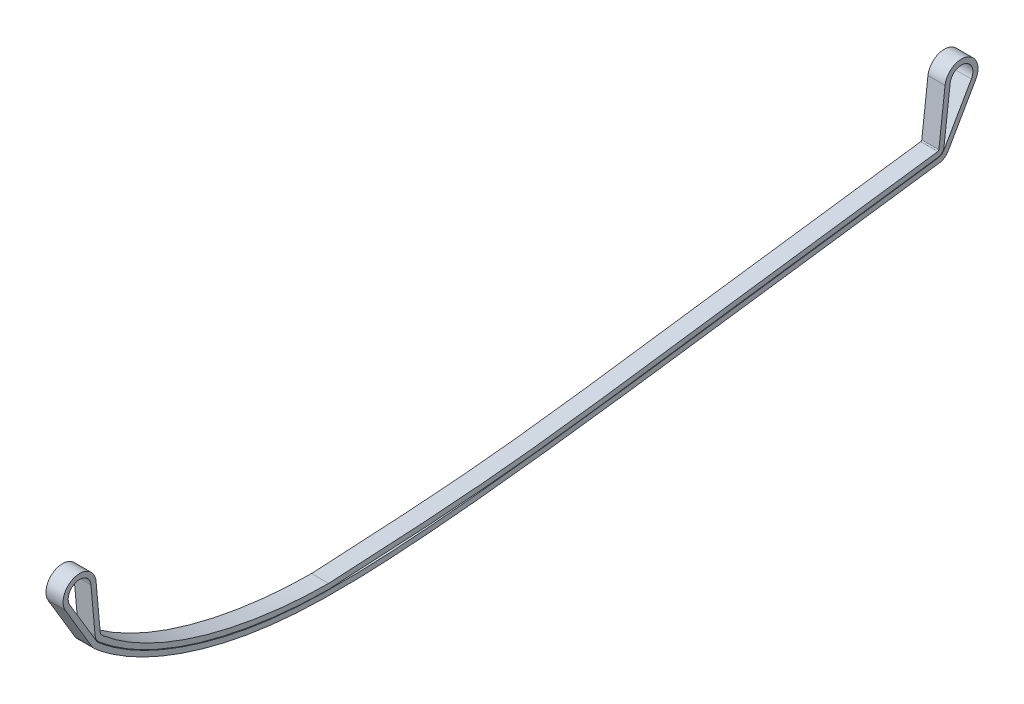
ISO-10303-21;
HEADER;
FILE_DESCRIPTION(('STEP AP214'),'2;1');
FILE_NAME('part.step','',(''),(''),'','','');
FILE_SCHEMA(('AUTOMOTIVE_DESIGN { 1 0 10303 214 1 1 1 1 }'));
ENDSEC;
DATA;
#1=APPLICATION_CONTEXT('core data for automotive mechanical design processes');
#2=APPLICATION_PROTOCOL_DEFINITION('international standard','automotive_design',2000,#1);
#3=PRODUCT_CONTEXT('',#1,'mechanical');
#4=PRODUCT('Part','Part','',(#3));
#5=PRODUCT_RELATED_PRODUCT_CATEGORY('part','',(#4));
#6=PRODUCT_DEFINITION_FORMATION('','',#4);
#7=PRODUCT_DEFINITION_CONTEXT('part definition',#1,'design');
#8=PRODUCT_DEFINITION('design','',#6,#7);
#9=PRODUCT_DEFINITION_SHAPE('','',#8);
#10=(LENGTH_UNIT() NAMED_UNIT(*) SI_UNIT(.MILLI.,.METRE.));
#11=(NAMED_UNIT(*) PLANE_ANGLE_UNIT() SI_UNIT($,.RADIAN.));
#12=(NAMED_UNIT(*) SI_UNIT($,.STERADIAN.) SOLID_ANGLE_UNIT());
#13=UNCERTAINTY_MEASURE_WITH_UNIT(LENGTH_MEASURE(1.E-05),#10,'distance_accuracy_value','');
#14=(GEOMETRIC_REPRESENTATION_CONTEXT(3) GLOBAL_UNCERTAINTY_ASSIGNED_CONTEXT((#13)) GLOBAL_UNIT_ASSIGNED_CONTEXT((#10,
#11,#12)) REPRESENTATION_CONTEXT('',''));
#15=CARTESIAN_POINT('',(0.,0.,0.));
#16=DIRECTION('',(0.,0.,1.));
#17=DIRECTION('',(1.,0.,0.));
#18=AXIS2_PLACEMENT_3D('',#15,#16,#17);
#19=CARTESIAN_POINT('',(0.,0.543527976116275,-1.05769693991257));
#20=DIRECTION('',(1.,0.,0.));
#21=DIRECTION('',(0.,0.,-1.));
#22=AXIS2_PLACEMENT_3D('',#19,#20,#21);
#23=CYLINDRICAL_SURFACE('',#22,2.05003127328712);
#24=CARTESIAN_POINT('',(-1.5,0.543527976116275,-1.05769693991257));
#25=DIRECTION('',(1.,0.,0.));
#26=DIRECTION('',(0.,0.,-1.));
#27=AXIS2_PLACEMENT_3D('',#24,#25,#26);
#28=CIRCLE('',#27,2.05003127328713);
#29=CARTESIAN_POINT('',(-1.5,0.360514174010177,0.984148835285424));
#30=VERTEX_POINT('',#29);
#31=CARTESIAN_POINT('',(-1.5,-1.02538381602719,0.261827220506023));
#32=VERTEX_POINT('',#31);
#33=EDGE_CURVE('E235',#30,#32,#28,.T.);
#34=ORIENTED_EDGE('',*,*,#33,.T.);
#35=DIRECTION('',(1.,0.,0.));
#36=VECTOR('',#35,1.);
#37=CARTESIAN_POINT('',(0.,-1.02538381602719,0.261827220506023));
#38=LINE('',#37,#36);
#39=CARTESIAN_POINT('',(1.5,-1.02538381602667,0.261827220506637));
#40=VERTEX_POINT('',#39);
#41=EDGE_CURVE('E12',#32,#40,#38,.T.);
#42=ORIENTED_EDGE('',*,*,#41,.T.);
#43=CARTESIAN_POINT('',(1.5,0.543527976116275,-1.05769693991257));
#44=DIRECTION('',(1.,0.,0.));
#45=DIRECTION('',(0.,0.,-1.));
#46=AXIS2_PLACEMENT_3D('',#43,#44,#45);
#47=CIRCLE('',#46,2.05003127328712);
#48=CARTESIAN_POINT('',(1.5,0.360514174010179,0.984148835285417));
#49=VERTEX_POINT('',#48);
#50=EDGE_CURVE('E232',#49,#40,#47,.T.);
#51=ORIENTED_EDGE('',*,*,#50,.F.);
#52=DIRECTION('',(-1.,0.,0.));
#53=VECTOR('',#52,1.);
#54=CARTESIAN_POINT('',(0.,0.360514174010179,0.984148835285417));
#55=LINE('',#54,#53);
#56=EDGE_CURVE('E250',#49,#30,#55,.T.);
#57=ORIENTED_EDGE('',*,*,#56,.T.);
#58=EDGE_LOOP('',(#34,#42,#51,#57));
#59=FACE_BOUND('',#58,.T.);
#60=ADVANCED_FACE('F38',(#59),#23,.T.);
#61=CARTESIAN_POINT('',(0.,0.543527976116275,-1.05769693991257));
#62=DIRECTION('',(1.,0.,0.));
#63=DIRECTION('',(0.,0.,-1.));
#64=AXIS2_PLACEMENT_3D('',#61,#62,#63);
#65=CYLINDRICAL_SURFACE('',#64,1.1500478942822);
#66=CARTESIAN_POINT('',(1.5,0.543527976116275,-1.05769693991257));
#67=DIRECTION('',(1.,0.,0.));
#68=DIRECTION('',(0.,0.,-1.));
#69=AXIS2_PLACEMENT_3D('',#66,#67,#68);
#70=CIRCLE('',#69,1.1500478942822);
#71=CARTESIAN_POINT('',(1.5,0.440858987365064,0.0877589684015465));
#72=VERTEX_POINT('',#71);
#73=CARTESIAN_POINT('',(1.5,-0.3366729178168,-0.317523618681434));
#74=VERTEX_POINT('',#73);
#75=EDGE_CURVE('E228',#72,#74,#70,.T.);
#76=ORIENTED_EDGE('',*,*,#75,.T.);
#77=DIRECTION('',(1.,0.,0.));
#78=VECTOR('',#77,1.);
#79=CARTESIAN_POINT('',(0.,-0.336672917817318,-0.317523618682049));
#80=LINE('',#79,#78);
#81=CARTESIAN_POINT('',(-1.5,-0.3366729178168,-0.317523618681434));
#82=VERTEX_POINT('',#81);
#83=EDGE_CURVE('E42',#74,#82,#80,.F.);
#84=ORIENTED_EDGE('',*,*,#83,.T.);
#85=CARTESIAN_POINT('',(-1.5,0.543527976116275,-1.05769693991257));
#86=DIRECTION('',(1.,0.,0.));
#87=DIRECTION('',(0.,0.,-1.));
#88=AXIS2_PLACEMENT_3D('',#85,#86,#87);
#89=CIRCLE('',#88,1.1500478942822);
#90=CARTESIAN_POINT('',(-1.5,0.440858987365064,0.0877589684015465));
#91=VERTEX_POINT('',#90);
#92=EDGE_CURVE('E60',#91,#82,#89,.T.);
#93=ORIENTED_EDGE('',*,*,#92,.F.);
#94=DIRECTION('',(1.,0.,0.));
#95=VECTOR('',#94,1.);
#96=CARTESIAN_POINT('',(0.,0.440858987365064,0.0877589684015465));
#97=LINE('',#96,#95);
#98=EDGE_CURVE('E229',#91,#72,#97,.T.);
#99=ORIENTED_EDGE('',*,*,#98,.T.);
#100=EDGE_LOOP('',(#76,#84,#93,#99));
#101=FACE_BOUND('',#100,.T.);
#102=ADVANCED_FACE('F40',(#101),#65,.F.);
#103=CARTESIAN_POINT('',(0.,8.46095613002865,0.806612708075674));
#104=DIRECTION('',(0.,0.0892736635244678,-0.996007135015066));
#105=DIRECTION('',(0.,0.996007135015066,0.0892736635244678));
#106=AXIS2_PLACEMENT_3D('',#103,#104,#105);
#107=PLANE('',#106);
#108=DIRECTION('',(1.,0.,0.));
#109=VECTOR('',#108,1.);
#110=CARTESIAN_POINT('',(0.,8.46095613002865,0.806612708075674));
#111=LINE('',#110,#109);
#112=CARTESIAN_POINT('',(-1.5,8.46095613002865,0.806612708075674));
#113=VERTEX_POINT('',#112);
#114=CARTESIAN_POINT('',(1.5,8.46095613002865,0.806612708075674));
#115=VERTEX_POINT('',#114);
#116=EDGE_CURVE('E264',#113,#115,#111,.T.);
#117=ORIENTED_EDGE('',*,*,#116,.T.);
#118=DIRECTION('',(0.,-0.996007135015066,-0.0892736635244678));
#119=VECTOR('',#118,1.);
#120=CARTESIAN_POINT('',(1.5,8.46095613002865,0.806612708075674));
#121=LINE('',#120,#119);
#122=EDGE_CURVE('E241',#115,#72,#121,.T.);
#123=ORIENTED_EDGE('',*,*,#122,.T.);
#124=ORIENTED_EDGE('',*,*,#98,.F.);
#125=DIRECTION('',(0.,-0.996007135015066,-0.0892736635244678));
#126=VECTOR('',#125,1.);
#127=CARTESIAN_POINT('',(-1.5,8.46095613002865,0.806612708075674));
#128=LINE('',#127,#126);
#129=EDGE_CURVE('E227',#113,#91,#128,.T.);
#130=ORIENTED_EDGE('',*,*,#129,.F.);
#131=EDGE_LOOP('',(#117,#123,#124,#130));
#132=FACE_BOUND('',#131,.T.);
#133=ADVANCED_FACE('F572',(#132),#107,.T.);
#134=CARTESIAN_POINT('',(0.,8.38061131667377,1.70300257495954));
#135=DIRECTION('',(0.,-0.0892736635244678,0.996007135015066));
#136=DIRECTION('',(0.,-0.996007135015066,-0.0892736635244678));
#137=AXIS2_PLACEMENT_3D('',#134,#135,#136);
#138=PLANE('',#137);
#139=DIRECTION('',(-1.,0.,0.));
#140=VECTOR('',#139,1.);
#141=CARTESIAN_POINT('',(0.,8.38061131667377,1.70300257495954));
#142=LINE('',#141,#140);
#143=CARTESIAN_POINT('',(1.5,8.38061131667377,1.70300257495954));
#144=VERTEX_POINT('',#143);
#145=CARTESIAN_POINT('',(-1.5,8.38061131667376,1.70300257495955));
#146=VERTEX_POINT('',#145);
#147=EDGE_CURVE('E267',#144,#146,#142,.T.);
#148=ORIENTED_EDGE('',*,*,#147,.T.);
#149=DIRECTION('',(0.,-0.996007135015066,-0.0892736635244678));
#150=VECTOR('',#149,1.);
#151=CARTESIAN_POINT('',(-1.5,8.38061131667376,1.70300257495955));
#152=LINE('',#151,#150);
#153=EDGE_CURVE('E246',#146,#30,#152,.T.);
#154=ORIENTED_EDGE('',*,*,#153,.T.);
#155=ORIENTED_EDGE('',*,*,#56,.F.);
#156=DIRECTION('',(0.,-0.996007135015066,-0.0892736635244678));
#157=VECTOR('',#156,1.);
#158=CARTESIAN_POINT('',(1.5,8.38061131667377,1.70300257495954));
#159=LINE('',#158,#157);
#160=EDGE_CURVE('E243',#144,#49,#159,.T.);
#161=ORIENTED_EDGE('',*,*,#160,.F.);
#162=EDGE_LOOP('',(#148,#154,#155,#161));
#163=FACE_BOUND('',#162,.T.);
#164=ADVANCED_FACE('F530',(#163),#138,.T.);
#165=CARTESIAN_POINT('',(0.,8.20206678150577,3.69498569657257));
#166=DIRECTION('',(-1.,0.,0.));
#167=DIRECTION('',(0.,0.,1.));
#168=AXIS2_PLACEMENT_3D('',#165,#166,#167);
#169=CYLINDRICAL_SURFACE('',#168,2.8999521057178);
#170=DIRECTION('',(1.,0.,0.));
#171=VECTOR('',#170,1.);
#172=CARTESIAN_POINT('',(0.,6.71416535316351,6.18413646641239));
#173=LINE('',#172,#171);
#174=CARTESIAN_POINT('',(-1.5,6.71416535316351,6.18413646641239));
#175=VERTEX_POINT('',#174);
#176=CARTESIAN_POINT('',(1.5,6.71416535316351,6.18413646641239));
#177=VERTEX_POINT('',#176);
#178=EDGE_CURVE('E282',#175,#177,#173,.T.);
#179=ORIENTED_EDGE('',*,*,#178,.T.);
#180=CARTESIAN_POINT('',(1.5,8.20206678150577,3.69498569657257));
#181=DIRECTION('',(-1.,0.,0.));
#182=DIRECTION('',(0.,0.,1.));
#183=AXIS2_PLACEMENT_3D('',#180,#181,#182);
#184=CIRCLE('',#183,2.8999521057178);
#185=EDGE_CURVE('E255',#177,#115,#184,.T.);
#186=ORIENTED_EDGE('',*,*,#185,.T.);
#187=ORIENTED_EDGE('',*,*,#116,.F.);
#188=CARTESIAN_POINT('',(-1.5,8.20206678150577,3.69498569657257));
#189=DIRECTION('',(-1.,0.,0.));
#190=DIRECTION('',(0.,0.,1.));
#191=AXIS2_PLACEMENT_3D('',#188,#189,#190);
#192=CIRCLE('',#191,2.8999521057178);
#193=EDGE_CURVE('E253',#175,#113,#192,.T.);
#194=ORIENTED_EDGE('',*,*,#193,.F.);
#195=EDGE_LOOP('',(#179,#186,#187,#194));
#196=FACE_BOUND('',#195,.T.);
#197=ADVANCED_FACE('F579',(#196),#169,.T.);
#198=CARTESIAN_POINT('',(0.,8.20206678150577,3.69498569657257));
#199=DIRECTION('',(-1.,0.,0.));
#200=DIRECTION('',(0.,0.,1.));
#201=AXIS2_PLACEMENT_3D('',#198,#199,#200);
#202=CYLINDRICAL_SURFACE('',#201,1.99996872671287);
#203=DIRECTION('',(-1.,0.,0.));
#204=VECTOR('',#203,1.);
#205=CARTESIAN_POINT('',(0.,7.17592696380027,5.4116429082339));
#206=LINE('',#205,#204);
#207=CARTESIAN_POINT('',(1.5,7.17592696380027,5.4116429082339));
#208=VERTEX_POINT('',#207);
#209=CARTESIAN_POINT('',(-1.5,7.17592696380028,5.41164290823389));
#210=VERTEX_POINT('',#209);
#211=EDGE_CURVE('E285',#208,#210,#206,.T.);
#212=ORIENTED_EDGE('',*,*,#211,.T.);
#213=CARTESIAN_POINT('',(-1.5,8.20206678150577,3.69498569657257));
#214=DIRECTION('',(-1.,0.,0.));
#215=DIRECTION('',(0.,0.,1.));
#216=AXIS2_PLACEMENT_3D('',#213,#214,#215);
#217=CIRCLE('',#216,1.99996872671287);
#218=EDGE_CURVE('E261',#210,#146,#217,.T.);
#219=ORIENTED_EDGE('',*,*,#218,.T.);
#220=ORIENTED_EDGE('',*,*,#147,.F.);
#221=CARTESIAN_POINT('',(1.5,8.20206678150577,3.69498569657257));
#222=DIRECTION('',(-1.,0.,0.));
#223=DIRECTION('',(0.,0.,1.));
#224=AXIS2_PLACEMENT_3D('',#221,#222,#223);
#225=CIRCLE('',#224,1.99996872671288);
#226=EDGE_CURVE('E258',#208,#144,#225,.T.);
#227=ORIENTED_EDGE('',*,*,#226,.F.);
#228=EDGE_LOOP('',(#212,#219,#220,#227));
#229=FACE_BOUND('',#228,.T.);
#230=ADVANCED_FACE('F532',(#229),#202,.F.);
#231=CARTESIAN_POINT('',(0.,-1.0213351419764,1.56020513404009));
#232=DIRECTION('',(0.,-0.513077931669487,0.858342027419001));
#233=DIRECTION('',(0.,-0.858342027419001,-0.513077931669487));
#234=AXIS2_PLACEMENT_3D('',#231,#232,#233);
#235=PLANE('',#234);
#236=DIRECTION('',(1.,0.,0.));
#237=VECTOR('',#236,1.);
#238=CARTESIAN_POINT('',(0.,-1.0213351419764,1.56020513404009));
#239=LINE('',#238,#237);
#240=CARTESIAN_POINT('',(-1.5,-1.0213351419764,1.56020513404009));
#241=VERTEX_POINT('',#240);
#242=CARTESIAN_POINT('',(1.5,-1.0213351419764,1.56020513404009));
#243=VERTEX_POINT('',#242);
#244=EDGE_CURVE('E459',#241,#243,#239,.T.);
#245=ORIENTED_EDGE('',*,*,#244,.T.);
#246=DIRECTION('',(0.,0.858342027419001,0.513077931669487));
#247=VECTOR('',#246,1.);
#248=CARTESIAN_POINT('',(1.5,-1.0213351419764,1.56020513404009));
#249=LINE('',#248,#247);
#250=EDGE_CURVE('E273',#243,#177,#249,.T.);
#251=ORIENTED_EDGE('',*,*,#250,.T.);
#252=ORIENTED_EDGE('',*,*,#178,.F.);
#253=DIRECTION('',(0.,0.858342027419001,0.513077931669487));
#254=VECTOR('',#253,1.);
#255=CARTESIAN_POINT('',(-1.5,-1.0213351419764,1.56020513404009));
#256=LINE('',#255,#254);
#257=EDGE_CURVE('E270',#241,#175,#256,.T.);
#258=ORIENTED_EDGE('',*,*,#257,.F.);
#259=EDGE_LOOP('',(#245,#251,#252,#258));
#260=FACE_BOUND('',#259,.T.);
#261=ADVANCED_FACE('F585',(#260),#235,.T.);
#262=CARTESIAN_POINT('',(0.,-0.559573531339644,0.787711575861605));
#263=DIRECTION('',(0.,0.513077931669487,-0.858342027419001));
#264=DIRECTION('',(0.,0.858342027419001,0.513077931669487));
#265=AXIS2_PLACEMENT_3D('',#262,#263,#264);
#266=PLANE('',#265);
#267=DIRECTION('',(-1.,0.,0.));
#268=VECTOR('',#267,1.);
#269=CARTESIAN_POINT('',(0.,-0.559573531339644,0.787711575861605));
#270=LINE('',#269,#268);
#271=CARTESIAN_POINT('',(1.5,-0.559573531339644,0.787711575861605));
#272=VERTEX_POINT('',#271);
#273=CARTESIAN_POINT('',(-1.5,-0.559573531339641,0.787711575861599));
#274=VERTEX_POINT('',#273);
#275=EDGE_CURVE('E451',#272,#274,#270,.T.);
#276=ORIENTED_EDGE('',*,*,#275,.T.);
#277=DIRECTION('',(0.,0.858342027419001,0.513077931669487));
#278=VECTOR('',#277,1.);
#279=CARTESIAN_POINT('',(-1.5,-0.559573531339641,0.787711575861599));
#280=LINE('',#279,#278);
#281=EDGE_CURVE('E279',#274,#210,#280,.T.);
#282=ORIENTED_EDGE('',*,*,#281,.T.);
#283=ORIENTED_EDGE('',*,*,#211,.F.);
#284=DIRECTION('',(0.,0.858342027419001,0.513077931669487));
#285=VECTOR('',#284,1.);
#286=CARTESIAN_POINT('',(1.5,-0.559573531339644,0.787711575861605));
#287=LINE('',#286,#285);
#288=EDGE_CURVE('E276',#272,#208,#287,.T.);
#289=ORIENTED_EDGE('',*,*,#288,.F.);
#290=EDGE_LOOP('',(#276,#282,#283,#289));
#291=FACE_BOUND('',#290,.T.);
#292=ADVANCED_FACE('F535',(#291),#266,.T.);
#293=CARTESIAN_POINT('',(0.,0.137415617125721,-146.855635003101));
#294=DIRECTION('',(-1.,0.,0.));
#295=DIRECTION('',(0.,0.,1.));
#296=AXIS2_PLACEMENT_3D('',#293,#294,#295);
#297=CYLINDRICAL_SURFACE('',#296,2.10597747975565);
#298=DIRECTION('',(1.,0.,0.));
#299=VECTOR('',#298,1.);
#300=CARTESIAN_POINT('',(0.,-0.910650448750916,-148.682298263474));
#301=LINE('',#300,#299);
#302=CARTESIAN_POINT('',(-1.5,-0.910650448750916,-148.682298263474));
#303=VERTEX_POINT('',#302);
#304=CARTESIAN_POINT('',(1.5,-0.910650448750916,-148.682298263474));
#305=VERTEX_POINT('',#304);
#306=EDGE_CURVE('E316',#303,#305,#301,.T.);
#307=ORIENTED_EDGE('',*,*,#306,.T.);
#308=CARTESIAN_POINT('',(1.5,0.137415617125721,-146.855635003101));
#309=DIRECTION('',(-1.,0.,0.));
#310=DIRECTION('',(0.,0.,1.));
#311=AXIS2_PLACEMENT_3D('',#308,#309,#310);
#312=CIRCLE('',#311,2.10597747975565);
#313=CARTESIAN_POINT('',(1.5,-1.94840734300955,-147.146295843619));
#314=VERTEX_POINT('',#313);
#315=EDGE_CURVE('E291',#305,#314,#312,.T.);
#316=ORIENTED_EDGE('',*,*,#315,.T.);
#317=DIRECTION('',(1.,0.,0.));
#318=VECTOR('',#317,1.);
#319=CARTESIAN_POINT('',(0.,-1.94840734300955,-147.146295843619));
#320=LINE('',#319,#318);
#321=CARTESIAN_POINT('',(-1.5,-1.94840734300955,-147.146295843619));
#322=VERTEX_POINT('',#321);
#323=EDGE_CURVE('E298',#322,#314,#320,.T.);
#324=ORIENTED_EDGE('',*,*,#323,.F.);
#325=CARTESIAN_POINT('',(-1.5,0.137415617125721,-146.855635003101));
#326=DIRECTION('',(-1.,0.,0.));
#327=DIRECTION('',(0.,0.,1.));
#328=AXIS2_PLACEMENT_3D('',#325,#326,#327);
#329=CIRCLE('',#328,2.10597747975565);
#330=EDGE_CURVE('E288',#303,#322,#329,.T.);
#331=ORIENTED_EDGE('',*,*,#330,.F.);
#332=EDGE_LOOP('',(#307,#316,#324,#331));
#333=FACE_BOUND('',#332,.T.);
#334=ADVANCED_FACE('F591',(#333),#297,.T.);
#335=CARTESIAN_POINT('',(0.,0.137415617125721,-146.855635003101));
#336=DIRECTION('',(-1.,0.,0.));
#337=DIRECTION('',(0.,0.,1.));
#338=AXIS2_PLACEMENT_3D('',#335,#336,#337);
#339=CYLINDRICAL_SURFACE('',#338,1.2059941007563);
#340=DIRECTION('',(-1.,0.,0.));
#341=VECTOR('',#340,1.);
#342=CARTESIAN_POINT('',(0.,-0.462762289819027,-147.901679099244));
#343=LINE('',#342,#341);
#344=CARTESIAN_POINT('',(1.5,-0.462762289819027,-147.901679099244));
#345=VERTEX_POINT('',#344);
#346=CARTESIAN_POINT('',(-1.5,-0.462762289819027,-147.901679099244));
#347=VERTEX_POINT('',#346);
#348=EDGE_CURVE('E319',#345,#347,#343,.T.);
#349=ORIENTED_EDGE('',*,*,#348,.T.);
#350=CARTESIAN_POINT('',(-1.5,0.137415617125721,-146.855635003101));
#351=DIRECTION('',(-1.,0.,0.));
#352=DIRECTION('',(0.,0.,1.));
#353=AXIS2_PLACEMENT_3D('',#350,#351,#352);
#354=CIRCLE('',#353,1.2059941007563);
#355=CARTESIAN_POINT('',(-1.5,-1.05703691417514,-147.022082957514));
#356=VERTEX_POINT('',#355);
#357=EDGE_CURVE('E296',#347,#356,#354,.T.);
#358=ORIENTED_EDGE('',*,*,#357,.T.);
#359=DIRECTION('',(-1.,0.,0.));
#360=VECTOR('',#359,1.);
#361=CARTESIAN_POINT('',(0.,-1.05703691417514,-147.022082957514));
#362=LINE('',#361,#360);
#363=CARTESIAN_POINT('',(1.5,-1.05703691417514,-147.022082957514));
#364=VERTEX_POINT('',#363);
#365=EDGE_CURVE('E301',#364,#356,#362,.T.);
#366=ORIENTED_EDGE('',*,*,#365,.F.);
#367=CARTESIAN_POINT('',(1.5,0.137415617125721,-146.855635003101));
#368=DIRECTION('',(-1.,0.,0.));
#369=DIRECTION('',(0.,0.,1.));
#370=AXIS2_PLACEMENT_3D('',#367,#368,#369);
#371=CIRCLE('',#370,1.2059941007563);
#372=EDGE_CURVE('E293',#345,#364,#371,.T.);
#373=ORIENTED_EDGE('',*,*,#372,.F.);
#374=EDGE_LOOP('',(#349,#358,#366,#373));
#375=FACE_BOUND('',#374,.T.);
#376=ADVANCED_FACE('F547',(#375),#339,.F.);
#377=CARTESIAN_POINT('',(0.,7.56394930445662,-153.544682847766));
#378=DIRECTION('',(0.,-0.497662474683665,-0.86737077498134));
#379=DIRECTION('',(0.,0.86737077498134,-0.497662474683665));
#380=AXIS2_PLACEMENT_3D('',#377,#378,#379);
#381=PLANE('',#380);
#382=DIRECTION('',(1.,0.,0.));
#383=VECTOR('',#382,1.);
#384=CARTESIAN_POINT('',(0.,7.56394930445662,-153.544682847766));
#385=LINE('',#384,#383);
#386=CARTESIAN_POINT('',(-1.5,7.56394930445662,-153.544682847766));
#387=VERTEX_POINT('',#386);
#388=CARTESIAN_POINT('',(1.5,7.56394930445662,-153.544682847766));
#389=VERTEX_POINT('',#388);
#390=EDGE_CURVE('E334',#387,#389,#385,.T.);
#391=ORIENTED_EDGE('',*,*,#390,.T.);
#392=DIRECTION('',(0.,-0.86737077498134,0.497662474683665));
#393=VECTOR('',#392,1.);
#394=CARTESIAN_POINT('',(1.5,7.56394930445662,-153.544682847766));
#395=LINE('',#394,#393);
#396=EDGE_CURVE('E307',#389,#305,#395,.T.);
#397=ORIENTED_EDGE('',*,*,#396,.T.);
#398=ORIENTED_EDGE('',*,*,#306,.F.);
#399=DIRECTION('',(0.,-0.86737077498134,0.497662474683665));
#400=VECTOR('',#399,1.);
#401=CARTESIAN_POINT('',(-1.5,7.56394930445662,-153.544682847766));
#402=LINE('',#401,#400);
#403=EDGE_CURVE('E304',#387,#303,#402,.T.);
#404=ORIENTED_EDGE('',*,*,#403,.F.);
#405=EDGE_LOOP('',(#391,#397,#398,#404));
#406=FACE_BOUND('',#405,.T.);
#407=ADVANCED_FACE('F597',(#406),#381,.T.);
#408=CARTESIAN_POINT('',(0.,8.01183746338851,-152.764063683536));
#409=DIRECTION('',(0.,0.497662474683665,0.86737077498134));
#410=DIRECTION('',(0.,-0.86737077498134,0.497662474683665));
#411=AXIS2_PLACEMENT_3D('',#408,#409,#410);
#412=PLANE('',#411);
#413=DIRECTION('',(-1.,0.,0.));
#414=VECTOR('',#413,1.);
#415=CARTESIAN_POINT('',(0.,8.01183746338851,-152.764063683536));
#416=LINE('',#415,#414);
#417=CARTESIAN_POINT('',(1.5,8.01183746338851,-152.764063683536));
#418=VERTEX_POINT('',#417);
#419=CARTESIAN_POINT('',(-1.5,8.01183746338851,-152.764063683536));
#420=VERTEX_POINT('',#419);
#421=EDGE_CURVE('E337',#418,#420,#416,.T.);
#422=ORIENTED_EDGE('',*,*,#421,.T.);
#423=DIRECTION('',(0.,-0.86737077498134,0.497662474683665));
#424=VECTOR('',#423,1.);
#425=CARTESIAN_POINT('',(-1.5,8.01183746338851,-152.764063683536));
#426=LINE('',#425,#424);
#427=EDGE_CURVE('E313',#420,#347,#426,.T.);
#428=ORIENTED_EDGE('',*,*,#427,.T.);
#429=ORIENTED_EDGE('',*,*,#348,.F.);
#430=DIRECTION('',(0.,-0.86737077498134,0.497662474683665));
#431=VECTOR('',#430,1.);
#432=CARTESIAN_POINT('',(1.5,8.01183746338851,-152.764063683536));
#433=LINE('',#432,#431);
#434=EDGE_CURVE('E310',#418,#345,#433,.T.);
#435=ORIENTED_EDGE('',*,*,#434,.F.);
#436=EDGE_LOOP('',(#422,#428,#429,#435));
#437=FACE_BOUND('',#436,.T.);
#438=ADVANCED_FACE('F549',(#437),#412,.T.);
#439=CARTESIAN_POINT('',(0.,9.00714674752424,-151.02934920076));
#440=DIRECTION('',(-1.,0.,0.));
#441=DIRECTION('',(0.,0.,1.));
#442=AXIS2_PLACEMENT_3D('',#439,#440,#441);
#443=CYLINDRICAL_SURFACE('',#442,2.89995210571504);
#444=DIRECTION('',(1.,0.,0.));
#445=VECTOR('',#444,1.);
#446=CARTESIAN_POINT('',(0.,9.34683307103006,-148.149360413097));
#447=LINE('',#446,#445);
#448=CARTESIAN_POINT('',(-1.5,9.34683307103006,-148.149360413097));
#449=VERTEX_POINT('',#448);
#450=CARTESIAN_POINT('',(1.5,9.34683307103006,-148.149360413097));
#451=VERTEX_POINT('',#450);
#452=EDGE_CURVE('E352',#449,#451,#447,.T.);
#453=ORIENTED_EDGE('',*,*,#452,.T.);
#454=CARTESIAN_POINT('',(1.5,9.00714674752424,-151.02934920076));
#455=DIRECTION('',(-1.,0.,0.));
#456=DIRECTION('',(0.,0.,1.));
#457=AXIS2_PLACEMENT_3D('',#454,#455,#456);
#458=CIRCLE('',#457,2.89995210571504);
#459=EDGE_CURVE('E325',#451,#389,#458,.T.);
#460=ORIENTED_EDGE('',*,*,#459,.T.);
#461=ORIENTED_EDGE('',*,*,#390,.F.);
#462=CARTESIAN_POINT('',(-1.5,9.00714674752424,-151.02934920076));
#463=DIRECTION('',(-1.,0.,0.));
#464=DIRECTION('',(0.,0.,1.));
#465=AXIS2_PLACEMENT_3D('',#462,#463,#464);
#466=CIRCLE('',#465,2.89995210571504);
#467=EDGE_CURVE('E322',#449,#387,#466,.T.);
#468=ORIENTED_EDGE('',*,*,#467,.F.);
#469=EDGE_LOOP('',(#453,#460,#461,#468));
#470=FACE_BOUND('',#469,.T.);
#471=ADVANCED_FACE('F603',(#470),#443,.T.);
#472=CARTESIAN_POINT('',(0.,9.00714674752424,-151.02934920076));
#473=DIRECTION('',(-1.,0.,0.));
#474=DIRECTION('',(0.,0.,1.));
#475=AXIS2_PLACEMENT_3D('',#472,#473,#474);
#476=CYLINDRICAL_SURFACE('',#475,1.9999687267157);
#477=DIRECTION('',(-1.,0.,0.));
#478=VECTOR('',#477,1.);
#479=CARTESIAN_POINT('',(0.,9.24141318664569,-149.043148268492));
#480=LINE('',#479,#478);
#481=CARTESIAN_POINT('',(1.5,9.24141318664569,-149.043148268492));
#482=VERTEX_POINT('',#481);
#483=CARTESIAN_POINT('',(-1.5,9.24141318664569,-149.043148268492));
#484=VERTEX_POINT('',#483);
#485=EDGE_CURVE('E355',#482,#484,#480,.T.);
#486=ORIENTED_EDGE('',*,*,#485,.T.);
#487=CARTESIAN_POINT('',(-1.5,9.00714674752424,-151.02934920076));
#488=DIRECTION('',(-1.,0.,0.));
#489=DIRECTION('',(0.,0.,1.));
#490=AXIS2_PLACEMENT_3D('',#487,#488,#489);
#491=CIRCLE('',#490,1.9999687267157);
#492=EDGE_CURVE('E331',#484,#420,#491,.T.);
#493=ORIENTED_EDGE('',*,*,#492,.T.);
#494=ORIENTED_EDGE('',*,*,#421,.F.);
#495=CARTESIAN_POINT('',(1.5,9.00714674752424,-151.02934920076));
#496=DIRECTION('',(-1.,0.,0.));
#497=DIRECTION('',(0.,0.,1.));
#498=AXIS2_PLACEMENT_3D('',#495,#496,#497);
#499=CIRCLE('',#498,1.9999687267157);
#500=EDGE_CURVE('E328',#482,#418,#499,.T.);
#501=ORIENTED_EDGE('',*,*,#500,.F.);
#502=EDGE_LOOP('',(#486,#493,#494,#501));
#503=FACE_BOUND('',#502,.T.);
#504=ADVANCED_FACE('F553',(#503),#476,.F.);
#505=CARTESIAN_POINT('',(0.,0.113277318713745,-147.060289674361));
#506=DIRECTION('',(0.,0.117135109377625,0.993115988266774));
#507=DIRECTION('',(0.,-0.993115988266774,0.117135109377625));
#508=AXIS2_PLACEMENT_3D('',#505,#506,#507);
#509=PLANE('',#508);
#510=DIRECTION('',(1.,0.,0.));
#511=VECTOR('',#510,1.);
#512=CARTESIAN_POINT('',(0.,0.113277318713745,-147.060289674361));
#513=LINE('',#512,#511);
#514=CARTESIAN_POINT('',(-1.5,0.113277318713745,-147.060289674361));
#515=VERTEX_POINT('',#514);
#516=CARTESIAN_POINT('',(1.5,0.113277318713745,-147.060289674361));
#517=VERTEX_POINT('',#516);
#518=EDGE_CURVE('E370',#515,#517,#513,.T.);
#519=ORIENTED_EDGE('',*,*,#518,.T.);
#520=DIRECTION('',(0.,0.993115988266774,-0.117135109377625));
#521=VECTOR('',#520,1.);
#522=CARTESIAN_POINT('',(1.5,0.113277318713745,-147.060289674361));
#523=LINE('',#522,#521);
#524=EDGE_CURVE('E343',#517,#451,#523,.T.);
#525=ORIENTED_EDGE('',*,*,#524,.T.);
#526=ORIENTED_EDGE('',*,*,#452,.F.);
#527=DIRECTION('',(0.,0.993115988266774,-0.117135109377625));
#528=VECTOR('',#527,1.);
#529=CARTESIAN_POINT('',(-1.5,0.113277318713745,-147.060289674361));
#530=LINE('',#529,#528);
#531=EDGE_CURVE('E340',#515,#449,#530,.T.);
#532=ORIENTED_EDGE('',*,*,#531,.F.);
#533=EDGE_LOOP('',(#519,#525,#526,#532));
#534=FACE_BOUND('',#533,.T.);
#535=ADVANCED_FACE('F558',(#534),#509,.T.);
#536=CARTESIAN_POINT('',(0.,0.00785743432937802,-147.954077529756));
#537=DIRECTION('',(0.,-0.117135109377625,-0.993115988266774));
#538=DIRECTION('',(0.,0.993115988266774,-0.117135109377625));
#539=AXIS2_PLACEMENT_3D('',#536,#537,#538);
#540=PLANE('',#539);
#541=DIRECTION('',(-1.,0.,0.));
#542=VECTOR('',#541,1.);
#543=CARTESIAN_POINT('',(0.,0.00785743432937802,-147.954077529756));
#544=LINE('',#543,#542);
#545=CARTESIAN_POINT('',(1.5,0.00785743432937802,-147.954077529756));
#546=VERTEX_POINT('',#545);
#547=CARTESIAN_POINT('',(-1.5,0.00785743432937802,-147.954077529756));
#548=VERTEX_POINT('',#547);
#549=EDGE_CURVE('E373',#546,#548,#544,.T.);
#550=ORIENTED_EDGE('',*,*,#549,.T.);
#551=DIRECTION('',(0.,0.993115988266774,-0.117135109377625));
#552=VECTOR('',#551,1.);
#553=CARTESIAN_POINT('',(-1.5,0.00785743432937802,-147.954077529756));
#554=LINE('',#553,#552);
#555=EDGE_CURVE('E349',#548,#484,#554,.T.);
#556=ORIENTED_EDGE('',*,*,#555,.T.);
#557=ORIENTED_EDGE('',*,*,#485,.F.);
#558=DIRECTION('',(0.,0.993115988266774,-0.117135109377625));
#559=VECTOR('',#558,1.);
#560=CARTESIAN_POINT('',(1.5,0.00785743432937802,-147.954077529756));
#561=LINE('',#560,#559);
#562=EDGE_CURVE('E346',#546,#482,#561,.T.);
#563=ORIENTED_EDGE('',*,*,#562,.F.);
#564=EDGE_LOOP('',(#550,#556,#557,#563));
#565=FACE_BOUND('',#564,.T.);
#566=ADVANCED_FACE('F555',(#565),#540,.T.);
#567=CARTESIAN_POINT('',(0.,0.137415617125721,-146.855635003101));
#568=DIRECTION('',(1.,0.,0.));
#569=DIRECTION('',(0.,0.,-1.));
#570=AXIS2_PLACEMENT_3D('',#567,#568,#569);
#571=CYLINDRICAL_SURFACE('',#570,0.206073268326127);
#572=DIRECTION('',(1.,0.,0.));
#573=VECTOR('',#572,1.);
#574=CARTESIAN_POINT('',(0.,-0.066685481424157,-146.884076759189));
#575=LINE('',#574,#573);
#576=CARTESIAN_POINT('',(-1.5,-0.066685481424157,-146.884076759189));
#577=VERTEX_POINT('',#576);
#578=CARTESIAN_POINT('',(1.5,-0.066685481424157,-146.884076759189));
#579=VERTEX_POINT('',#578);
#580=EDGE_CURVE('E386',#577,#579,#575,.T.);
#581=ORIENTED_EDGE('',*,*,#580,.T.);
#582=CARTESIAN_POINT('',(1.5,0.137415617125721,-146.855635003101));
#583=DIRECTION('',(1.,0.,0.));
#584=DIRECTION('',(0.,0.,-1.));
#585=AXIS2_PLACEMENT_3D('',#582,#583,#584);
#586=CIRCLE('',#585,0.206073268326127);
#587=EDGE_CURVE('E361',#579,#517,#586,.T.);
#588=ORIENTED_EDGE('',*,*,#587,.T.);
#589=ORIENTED_EDGE('',*,*,#518,.F.);
#590=CARTESIAN_POINT('',(-1.5,0.137415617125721,-146.855635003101));
#591=DIRECTION('',(1.,0.,0.));
#592=DIRECTION('',(0.,0.,-1.));
#593=AXIS2_PLACEMENT_3D('',#590,#591,#592);
#594=CIRCLE('',#593,0.206073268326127);
#595=EDGE_CURVE('E358',#577,#515,#594,.T.);
#596=ORIENTED_EDGE('',*,*,#595,.F.);
#597=EDGE_LOOP('',(#581,#588,#589,#596));
#598=FACE_BOUND('',#597,.T.);
#599=ADVANCED_FACE('F557',(#598),#571,.F.);
#600=CARTESIAN_POINT('',(0.,0.137415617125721,-146.855635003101));
#601=DIRECTION('',(1.,0.,0.));
#602=DIRECTION('',(0.,0.,-1.));
#603=AXIS2_PLACEMENT_3D('',#600,#601,#602);
#604=CYLINDRICAL_SURFACE('',#603,1.10605664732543);
#605=DIRECTION('',(-1.,0.,0.));
#606=VECTOR('',#605,1.);
#607=CARTESIAN_POINT('',(0.,-0.958055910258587,-147.008289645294));
#608=LINE('',#607,#606);
#609=CARTESIAN_POINT('',(1.5,-0.958055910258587,-147.008289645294));
#610=VERTEX_POINT('',#609);
#611=CARTESIAN_POINT('',(-1.5,-0.958055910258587,-147.008289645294));
#612=VERTEX_POINT('',#611);
#613=EDGE_CURVE('E380',#610,#612,#608,.T.);
#614=ORIENTED_EDGE('',*,*,#613,.T.);
#615=CARTESIAN_POINT('',(-1.5,0.137415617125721,-146.855635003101));
#616=DIRECTION('',(1.,0.,0.));
#617=DIRECTION('',(0.,0.,-1.));
#618=AXIS2_PLACEMENT_3D('',#615,#616,#617);
#619=CIRCLE('',#618,1.10605664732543);
#620=EDGE_CURVE('E367',#612,#548,#619,.T.);
#621=ORIENTED_EDGE('',*,*,#620,.T.);
#622=ORIENTED_EDGE('',*,*,#549,.F.);
#623=CARTESIAN_POINT('',(1.5,0.137415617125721,-146.855635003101));
#624=DIRECTION('',(1.,0.,0.));
#625=DIRECTION('',(0.,0.,-1.));
#626=AXIS2_PLACEMENT_3D('',#623,#624,#625);
#627=CIRCLE('',#626,1.10605664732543);
#628=EDGE_CURVE('E364',#610,#546,#627,.T.);
#629=ORIENTED_EDGE('',*,*,#628,.F.);
#630=EDGE_LOOP('',(#614,#621,#622,#629));
#631=FACE_BOUND('',#630,.T.);
#632=ADVANCED_FACE('F523',(#631),#604,.T.);
#633=CARTESIAN_POINT('',(-1.5,-13.15,-39.9999999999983));
#634=DIRECTION('',(-1.,0.,0.));
#635=DIRECTION('',(0.,1.,0.));
#636=AXIS2_PLACEMENT_3D('',#633,#634,#635);
#637=PLANE('',#636);
#638=CARTESIAN_POINT('',(-1.5,-1.79065938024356,0.905407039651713));
#639=CARTESIAN_POINT('',(-1.5,-1.72973197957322,0.977853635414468));
#640=CARTESIAN_POINT('',(-1.5,-1.60040693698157,1.1174990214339));
#641=CARTESIAN_POINT('',(-1.5,-1.34945113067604,1.34271969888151));
#642=CARTESIAN_POINT('',(-1.5,-1.14898626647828,1.48390108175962));
#643=CARTESIAN_POINT('',(-1.5,-1.0213351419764,1.56020513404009));
#644=B_SPLINE_CURVE_WITH_KNOTS('',3,(#638,#639,#640,#641,#642,#643),.UNSPECIFIED.,.F.,.F.,(4,1,
1,4),(0.,0.27962418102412,0.560281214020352,1.),.UNSPECIFIED.);
#645=CARTESIAN_POINT('',(-1.5,-1.7906593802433,0.905407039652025));
#646=VERTEX_POINT('',#645);
#647=EDGE_CURVE('E422',#646,#241,#644,.T.);
#648=ORIENTED_EDGE('',*,*,#647,.T.);
#649=ORIENTED_EDGE('',*,*,#257,.T.);
#650=ORIENTED_EDGE('',*,*,#193,.T.);
#651=ORIENTED_EDGE('',*,*,#129,.T.);
#652=ORIENTED_EDGE('',*,*,#92,.T.);
#653=CARTESIAN_POINT('',(-1.5,-0.3366729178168,-0.317523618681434));
#654=CARTESIAN_POINT('',(-1.5,-1.94911997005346,-2.23385567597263));
#655=CARTESIAN_POINT('',(-1.5,-4.79592613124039,-6.52968050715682));
#656=CARTESIAN_POINT('',(-1.5,-7.97059614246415,-13.7145246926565));
#657=CARTESIAN_POINT('',(-1.5,-10.3618227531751,-21.8949344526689));
#658=CARTESIAN_POINT('',(-1.5,-11.8612874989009,-30.7201344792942));
#659=CARTESIAN_POINT('',(-1.5,-12.2372683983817,-36.951736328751));
#660=CARTESIAN_POINT('',(-1.5,-12.2500087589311,-39.9999999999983));
#661=B_SPLINE_CURVE_WITH_KNOTS('',3,(#653,#654,#655,#656,#657,#658,#659,#660),.UNSPECIFIED.,.F.,
.F.,(4,1,1,1,1,4),(0.,0.178914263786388,0.36569398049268,0.557479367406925,0.783466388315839,
1.),.UNSPECIFIED.);
#662=CARTESIAN_POINT('',(-1.5,-12.2500087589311,-39.9999999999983));
#663=VERTEX_POINT('',#662);
#664=EDGE_CURVE('E212',#82,#663,#661,.T.);
#665=ORIENTED_EDGE('',*,*,#664,.T.);
#666=CARTESIAN_POINT('',(-1.5,-12.2500087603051,-39.9999999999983));
#667=CARTESIAN_POINT('',(-1.5,-11.7337968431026,-49.9879868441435));
#668=CARTESIAN_POINT('',(-1.5,-10.6948191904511,-70.0907678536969));
#669=CARTESIAN_POINT('',(-1.5,-5.65879632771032,-105.665556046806));
#670=CARTESIAN_POINT('',(-1.5,-2.1808141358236,-131.301185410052));
#671=CARTESIAN_POINT('',(-1.5,-0.066685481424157,-146.884076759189));
#672=B_SPLINE_CURVE_WITH_KNOTS('',3,(#666,#667,#668,#669,#670,#671),.UNSPECIFIED.,.F.,.F.,(4,1,
1,4),(0.,0.279135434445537,0.561814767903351,1.),.UNSPECIFIED.);
#673=EDGE_CURVE('E376',#663,#577,#672,.T.);
#674=ORIENTED_EDGE('',*,*,#673,.T.);
#675=ORIENTED_EDGE('',*,*,#595,.T.);
#676=ORIENTED_EDGE('',*,*,#531,.T.);
#677=ORIENTED_EDGE('',*,*,#467,.T.);
#678=ORIENTED_EDGE('',*,*,#403,.T.);
#679=ORIENTED_EDGE('',*,*,#330,.T.);
#680=CARTESIAN_POINT('',(-1.5,-1.94840734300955,-147.146295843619));
#681=CARTESIAN_POINT('',(-1.5,-3.85976042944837,-133.430143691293));
#682=CARTESIAN_POINT('',(-1.5,-7.62238004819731,-105.792738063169));
#683=CARTESIAN_POINT('',(-1.5,-12.1687901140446,-72.6987072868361));
#684=CARTESIAN_POINT('',(-1.5,-14.2352891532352,-47.7427890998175));
#685=CARTESIAN_POINT('',(-1.5,-14.1998517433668,-30.7994603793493));
#686=CARTESIAN_POINT('',(-1.5,-10.7145157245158,-14.0606479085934));
#687=CARTESIAN_POINT('',(-1.5,-5.4359022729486,-3.42727286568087));
#688=CARTESIAN_POINT('',(-1.5,-1.7906593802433,0.905407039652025));
#689=B_SPLINE_CURVE_WITH_KNOTS('',3,(#680,#681,#682,#683,#684,#685,#686,#687,#688),
.UNSPECIFIED.,.F.,.F.,(4,1,1,1,1,1,4),(0.,0.275354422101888,0.554681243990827,0.663841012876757,
0.772665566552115,0.888576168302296,1.),.UNSPECIFIED.);
#690=EDGE_CURVE('E381',#322,#646,#689,.T.);
#691=ORIENTED_EDGE('',*,*,#690,.T.);
#692=EDGE_LOOP('',(#648,#649,#650,#651,#652,#665,#674,#675,#676,#677,#678,#679,#691));
#693=FACE_BOUND('',#692,.T.);
#694=CARTESIAN_POINT('',(-1.5,-13.15,-39.9999999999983));
#695=CARTESIAN_POINT('',(-1.5,-12.631563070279,-50.0290880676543));
#696=CARTESIAN_POINT('',(-1.5,-11.5881071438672,-70.2145933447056));
#697=CARTESIAN_POINT('',(-1.5,-6.55074261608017,-105.779784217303));
#698=CARTESIAN_POINT('',(-1.5,-3.07240227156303,-131.421623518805));
#699=CARTESIAN_POINT('',(-1.5,-0.958055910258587,-147.008289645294));
#700=B_SPLINE_CURVE_WITH_KNOTS('',3,(#694,#695,#696,#697,#698,#699),.UNSPECIFIED.,.F.,.F.,(4,1,
1,4),(0.,0.279135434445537,0.561814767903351,1.),.UNSPECIFIED.);
#701=CARTESIAN_POINT('',(-1.5,-13.149999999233,-39.9999999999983));
#702=VERTEX_POINT('',#701);
#703=EDGE_CURVE('E384',#702,#612,#700,.T.);
#704=ORIENTED_EDGE('',*,*,#703,.F.);
#705=CARTESIAN_POINT('',(-1.5,-1.02538381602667,0.261827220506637));
#706=CARTESIAN_POINT('',(-1.5,-2.67576826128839,-1.6995919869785));
#707=CARTESIAN_POINT('',(-1.5,-5.59618108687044,-6.1067136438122));
#708=CARTESIAN_POINT('',(-1.5,-8.81937339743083,-13.4090598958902));
#709=CARTESIAN_POINT('',(-1.5,-11.2421018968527,-21.6978967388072));
#710=CARTESIAN_POINT('',(-1.5,-12.7569956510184,-30.6152781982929));
#711=CARTESIAN_POINT('',(-1.5,-13.1371176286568,-36.9177589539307));
#712=CARTESIAN_POINT('',(-1.5,-13.149999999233,-39.9999999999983));
#713=B_SPLINE_CURVE_WITH_KNOTS('',3,(#705,#706,#707,#708,#709,#710,#711,#712),.UNSPECIFIED.,.F.,
.F.,(4,1,1,1,1,4),(0.,0.178914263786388,0.36569398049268,0.557479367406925,0.783466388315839,
1.),.UNSPECIFIED.);
#714=EDGE_CURVE('E220',#32,#702,#713,.T.);
#715=ORIENTED_EDGE('',*,*,#714,.F.);
#716=ORIENTED_EDGE('',*,*,#33,.F.);
#717=ORIENTED_EDGE('',*,*,#153,.F.);
#718=ORIENTED_EDGE('',*,*,#218,.F.);
#719=ORIENTED_EDGE('',*,*,#281,.F.);
#720=CARTESIAN_POINT('',(-1.5,-1.10193375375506,0.326073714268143));
#721=CARTESIAN_POINT('',(-1.5,-1.05910284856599,0.377002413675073));
#722=CARTESIAN_POINT('',(-1.5,-0.96853725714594,0.474833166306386));
#723=CARTESIAN_POINT('',(-1.5,-0.790174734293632,0.634898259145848));
#724=CARTESIAN_POINT('',(-1.5,-0.649496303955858,0.733959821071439));
#725=CARTESIAN_POINT('',(-1.5,-0.559573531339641,0.787711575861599));
#726=B_SPLINE_CURVE_WITH_KNOTS('',3,(#720,#721,#722,#723,#724,#725),.UNSPECIFIED.,.F.,.F.,(4,1,
1,4),(0.,0.27962418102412,0.560281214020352,1.),.UNSPECIFIED.);
#727=CARTESIAN_POINT('',(-1.5,-1.1019337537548,0.326073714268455));
#728=VERTEX_POINT('',#727);
#729=EDGE_CURVE('E457',#728,#274,#726,.T.);
#730=ORIENTED_EDGE('',*,*,#729,.F.);
#731=CARTESIAN_POINT('',(-1.5,-1.05703691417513,-147.022082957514));
#732=CARTESIAN_POINT('',(-1.5,-2.96815707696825,-133.307602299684));
#733=CARTESIAN_POINT('',(-1.5,-6.72997533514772,-105.673378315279));
#734=CARTESIAN_POINT('',(-1.5,-11.277096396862,-72.5840590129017));
#735=CARTESIAN_POINT('',(-1.5,-13.3344303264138,-47.6886295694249));
#736=CARTESIAN_POINT('',(-1.5,-13.3026094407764,-30.8969559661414));
#737=CARTESIAN_POINT('',(-1.5,-9.83667510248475,-14.321831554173));
#738=CARTESIAN_POINT('',(-1.5,-4.67716103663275,-3.92338670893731));
#739=CARTESIAN_POINT('',(-1.5,-1.1019337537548,0.326073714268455));
#740=B_SPLINE_CURVE_WITH_KNOTS('',3,(#731,#732,#733,#734,#735,#736,#737,#738,#739),
.UNSPECIFIED.,.F.,.F.,(4,1,1,1,1,1,4),(0.,0.275354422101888,0.554681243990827,0.663841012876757,
0.772665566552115,0.888576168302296,1.),.UNSPECIFIED.);
#741=EDGE_CURVE('E421',#356,#728,#740,.T.);
#742=ORIENTED_EDGE('',*,*,#741,.F.);
#743=ORIENTED_EDGE('',*,*,#357,.F.);
#744=ORIENTED_EDGE('',*,*,#427,.F.);
#745=ORIENTED_EDGE('',*,*,#492,.F.);
#746=ORIENTED_EDGE('',*,*,#555,.F.);
#747=ORIENTED_EDGE('',*,*,#620,.F.);
#748=EDGE_LOOP('',(#704,#715,#716,#717,#718,#719,#730,#742,#743,#744,#745,#746,#747));
#749=FACE_BOUND('',#748,.T.);
#750=ADVANCED_FACE('F224',(#693,#749),#637,.T.);
#751=CARTESIAN_POINT('',(-1.5,-12.2500087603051,-39.9999999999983));
#752=CARTESIAN_POINT('',(-1.5,-11.7337968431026,-49.9879868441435));
#753=CARTESIAN_POINT('',(-1.5,-10.6948191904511,-70.0907678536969));
#754=CARTESIAN_POINT('',(-1.5,-5.65879632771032,-105.665556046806));
#755=CARTESIAN_POINT('',(-1.5,-2.1808141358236,-131.301185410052));
#756=CARTESIAN_POINT('',(-1.5,-0.066685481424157,-146.884076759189));
#757=CARTESIAN_POINT('',(1.5,-12.2500087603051,-39.9999999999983));
#758=CARTESIAN_POINT('',(1.5,-11.7337968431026,-49.9879868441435));
#759=CARTESIAN_POINT('',(1.5,-10.6948191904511,-70.0907678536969));
#760=CARTESIAN_POINT('',(1.5,-5.65879632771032,-105.665556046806));
#761=CARTESIAN_POINT('',(1.5,-2.1808141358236,-131.301185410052));
#762=CARTESIAN_POINT('',(1.5,-0.066685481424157,-146.884076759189));
#763=B_SPLINE_SURFACE_WITH_KNOTS('',1,3,((#751,#752,#753,#754,#755,#756),(#757,#758,#759,#760,
#761,#762)),.UNSPECIFIED.,.F.,.F.,.F.,(2,2),(4,1,1,4),(0.115383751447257,0.5),(0.,
0.279135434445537,0.561814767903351,1.),.UNSPECIFIED.);
#764=DIRECTION('',(1.,0.,0.));
#765=VECTOR('',#764,1.);
#766=CARTESIAN_POINT('',(0.,-12.2500087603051,-39.9999999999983));
#767=LINE('',#766,#765);
#768=CARTESIAN_POINT('',(1.5,-12.2500087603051,-39.9999999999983));
#769=VERTEX_POINT('',#768);
#770=EDGE_CURVE('E216',#663,#769,#767,.T.);
#771=CARTESIAN_POINT('',(1.5,-12.2500087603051,-39.9999999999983));
#772=CARTESIAN_POINT('',(1.5,-11.7337968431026,-49.9879868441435));
#773=CARTESIAN_POINT('',(1.5,-10.6948191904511,-70.0907678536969));
#774=CARTESIAN_POINT('',(1.5,-5.65879632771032,-105.665556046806));
#775=CARTESIAN_POINT('',(1.5,-2.1808141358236,-131.301185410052));
#776=CARTESIAN_POINT('',(1.5,-0.066685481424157,-146.884076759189));
#777=B_SPLINE_CURVE_WITH_KNOTS('',3,(#771,#772,#773,#774,#775,#776),.UNSPECIFIED.,.F.,.F.,(4,1,
1,4),(0.,0.279135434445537,0.561814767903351,1.),.UNSPECIFIED.);
#778=EDGE_CURVE('E387',#769,#579,#777,.T.);
#779=ORIENTED_EDGE('',*,*,#770,.T.);
#780=ORIENTED_EDGE('',*,*,#778,.T.);
#781=ORIENTED_EDGE('',*,*,#580,.F.);
#782=ORIENTED_EDGE('',*,*,#673,.F.);
#783=EDGE_LOOP('',(#779,#780,#781,#782));
#784=FACE_BOUND('',#783,.T.);
#785=ADVANCED_FACE('F644',(#784),#763,.T.);
#786=CARTESIAN_POINT('',(1.5,-12.2500087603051,-39.9999999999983));
#787=DIRECTION('',(1.,0.,0.));
#788=DIRECTION('',(0.,-1.,0.));
#789=AXIS2_PLACEMENT_3D('',#786,#787,#788);
#790=PLANE('',#789);
#791=CARTESIAN_POINT('',(1.5,-1.10193375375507,0.326073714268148));
#792=CARTESIAN_POINT('',(1.5,-1.059102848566,0.377002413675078));
#793=CARTESIAN_POINT('',(1.5,-0.968537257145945,0.474833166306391));
#794=CARTESIAN_POINT('',(1.5,-0.790174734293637,0.634898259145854));
#795=CARTESIAN_POINT('',(1.5,-0.649496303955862,0.733959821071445));
#796=CARTESIAN_POINT('',(1.5,-0.559573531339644,0.787711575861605));
#797=B_SPLINE_CURVE_WITH_KNOTS('',3,(#791,#792,#793,#794,#795,#796),.UNSPECIFIED.,.F.,.F.,(4,1,
1,4),(0.,0.27962418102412,0.560281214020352,1.),.UNSPECIFIED.);
#798=CARTESIAN_POINT('',(1.5,-1.10193375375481,0.326073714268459));
#799=VERTEX_POINT('',#798);
#800=EDGE_CURVE('E473',#799,#272,#797,.T.);
#801=ORIENTED_EDGE('',*,*,#800,.T.);
#802=ORIENTED_EDGE('',*,*,#288,.T.);
#803=ORIENTED_EDGE('',*,*,#226,.T.);
#804=ORIENTED_EDGE('',*,*,#160,.T.);
#805=ORIENTED_EDGE('',*,*,#50,.T.);
#806=CARTESIAN_POINT('',(1.5,-1.02538381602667,0.261827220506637));
#807=CARTESIAN_POINT('',(1.5,-2.67576826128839,-1.6995919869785));
#808=CARTESIAN_POINT('',(1.5,-5.59618108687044,-6.1067136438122));
#809=CARTESIAN_POINT('',(1.5,-8.81937339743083,-13.4090598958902));
#810=CARTESIAN_POINT('',(1.5,-11.2421018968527,-21.6978967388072));
#811=CARTESIAN_POINT('',(1.5,-12.7569956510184,-30.6152781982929));
#812=CARTESIAN_POINT('',(1.5,-13.1371176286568,-36.9177589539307));
#813=CARTESIAN_POINT('',(1.5,-13.149999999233,-39.9999999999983));
#814=B_SPLINE_CURVE_WITH_KNOTS('',3,(#806,#807,#808,#809,#810,#811,#812,#813),.UNSPECIFIED.,.F.,
.F.,(4,1,1,1,1,4),(0.,0.178914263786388,0.36569398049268,0.557479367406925,0.783466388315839,
1.),.UNSPECIFIED.);
#815=CARTESIAN_POINT('',(1.5,-13.149999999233,-39.9999999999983));
#816=VERTEX_POINT('',#815);
#817=EDGE_CURVE('E494',#40,#816,#814,.T.);
#818=ORIENTED_EDGE('',*,*,#817,.T.);
#819=CARTESIAN_POINT('',(1.5,-13.15,-39.9999999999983));
#820=CARTESIAN_POINT('',(1.5,-12.631563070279,-50.0290880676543));
#821=CARTESIAN_POINT('',(1.5,-11.5881071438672,-70.2145933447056));
#822=CARTESIAN_POINT('',(1.5,-6.55074261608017,-105.779784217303));
#823=CARTESIAN_POINT('',(1.5,-3.07240227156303,-131.421623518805));
#824=CARTESIAN_POINT('',(1.5,-0.958055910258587,-147.008289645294));
#825=B_SPLINE_CURVE_WITH_KNOTS('',3,(#819,#820,#821,#822,#823,#824),.UNSPECIFIED.,.F.,.F.,(4,1,
1,4),(0.,0.279135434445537,0.561814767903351,1.),.UNSPECIFIED.);
#826=EDGE_CURVE('E400',#816,#610,#825,.T.);
#827=ORIENTED_EDGE('',*,*,#826,.T.);
#828=ORIENTED_EDGE('',*,*,#628,.T.);
#829=ORIENTED_EDGE('',*,*,#562,.T.);
#830=ORIENTED_EDGE('',*,*,#500,.T.);
#831=ORIENTED_EDGE('',*,*,#434,.T.);
#832=ORIENTED_EDGE('',*,*,#372,.T.);
#833=CARTESIAN_POINT('',(1.5,-1.05703691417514,-147.022082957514));
#834=CARTESIAN_POINT('',(1.5,-2.96815707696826,-133.307602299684));
#835=CARTESIAN_POINT('',(1.5,-6.72997533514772,-105.673378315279));
#836=CARTESIAN_POINT('',(1.5,-11.277096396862,-72.5840590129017));
#837=CARTESIAN_POINT('',(1.5,-13.3344303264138,-47.6886295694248));
#838=CARTESIAN_POINT('',(1.5,-13.3026094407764,-30.8969559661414));
#839=CARTESIAN_POINT('',(1.5,-9.83667510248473,-14.3218315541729));
#840=CARTESIAN_POINT('',(1.5,-4.67716103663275,-3.9233867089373));
#841=CARTESIAN_POINT('',(1.5,-1.10193375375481,0.326073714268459));
#842=B_SPLINE_CURVE_WITH_KNOTS('',3,(#833,#834,#835,#836,#837,#838,#839,#840,#841),
.UNSPECIFIED.,.F.,.F.,(4,1,1,1,1,1,4),(0.,0.275354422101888,0.554681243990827,0.663841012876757,
0.772665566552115,0.888576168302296,1.),.UNSPECIFIED.);
#843=EDGE_CURVE('E437',#364,#799,#842,.T.);
#844=ORIENTED_EDGE('',*,*,#843,.T.);
#845=EDGE_LOOP('',(#801,#802,#803,#804,#805,#818,#827,#828,#829,#830,#831,#832,#844));
#846=FACE_BOUND('',#845,.T.);
#847=ORIENTED_EDGE('',*,*,#778,.F.);
#848=CARTESIAN_POINT('',(1.5,-0.3366729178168,-0.317523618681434));
#849=CARTESIAN_POINT('',(1.5,-1.94911997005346,-2.23385567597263));
#850=CARTESIAN_POINT('',(1.5,-4.79592613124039,-6.52968050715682));
#851=CARTESIAN_POINT('',(1.5,-7.97059614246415,-13.7145246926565));
#852=CARTESIAN_POINT('',(1.5,-10.3618227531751,-21.8949344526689));
#853=CARTESIAN_POINT('',(1.5,-11.8612874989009,-30.7201344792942));
#854=CARTESIAN_POINT('',(1.5,-12.2372683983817,-36.951736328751));
#855=CARTESIAN_POINT('',(1.5,-12.2500087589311,-39.9999999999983));
#856=B_SPLINE_CURVE_WITH_KNOTS('',3,(#848,#849,#850,#851,#852,#853,#854,#855),.UNSPECIFIED.,.F.,
.F.,(4,1,1,1,1,4),(0.,0.178914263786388,0.36569398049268,0.557479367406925,0.783466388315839,
1.),.UNSPECIFIED.);
#857=EDGE_CURVE('E458',#74,#769,#856,.T.);
#858=ORIENTED_EDGE('',*,*,#857,.F.);
#859=ORIENTED_EDGE('',*,*,#75,.F.);
#860=ORIENTED_EDGE('',*,*,#122,.F.);
#861=ORIENTED_EDGE('',*,*,#185,.F.);
#862=ORIENTED_EDGE('',*,*,#250,.F.);
#863=CARTESIAN_POINT('',(1.5,-1.79065938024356,0.905407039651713));
#864=CARTESIAN_POINT('',(1.5,-1.72973197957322,0.977853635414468));
#865=CARTESIAN_POINT('',(1.5,-1.60040693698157,1.1174990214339));
#866=CARTESIAN_POINT('',(1.5,-1.34945113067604,1.34271969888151));
#867=CARTESIAN_POINT('',(1.5,-1.14898626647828,1.48390108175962));
#868=CARTESIAN_POINT('',(1.5,-1.0213351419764,1.56020513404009));
#869=B_SPLINE_CURVE_WITH_KNOTS('',3,(#863,#864,#865,#866,#867,#868),.UNSPECIFIED.,.F.,.F.,(4,1,
1,4),(0.,0.27962418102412,0.560281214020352,1.),.UNSPECIFIED.);
#870=CARTESIAN_POINT('',(1.5,-1.79065938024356,0.905407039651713));
#871=VERTEX_POINT('',#870);
#872=EDGE_CURVE('E462',#871,#243,#869,.T.);
#873=ORIENTED_EDGE('',*,*,#872,.F.);
#874=CARTESIAN_POINT('',(1.5,-1.94840734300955,-147.146295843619));
#875=CARTESIAN_POINT('',(1.5,-3.85976042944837,-133.430143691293));
#876=CARTESIAN_POINT('',(1.5,-7.62238004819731,-105.792738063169));
#877=CARTESIAN_POINT('',(1.5,-12.1687901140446,-72.6987072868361));
#878=CARTESIAN_POINT('',(1.5,-14.2352891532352,-47.7427890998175));
#879=CARTESIAN_POINT('',(1.5,-14.1998517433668,-30.7994603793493));
#880=CARTESIAN_POINT('',(1.5,-10.7145157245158,-14.0606479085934));
#881=CARTESIAN_POINT('',(1.5,-5.43590227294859,-3.42727286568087));
#882=CARTESIAN_POINT('',(1.5,-1.7906593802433,0.905407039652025));
#883=B_SPLINE_CURVE_WITH_KNOTS('',3,(#874,#875,#876,#877,#878,#879,#880,#881,#882),
.UNSPECIFIED.,.F.,.F.,(4,1,1,1,1,1,4),(0.,0.275354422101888,0.554681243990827,0.663841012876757,
0.772665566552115,0.888576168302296,1.),.UNSPECIFIED.);
#884=EDGE_CURVE('E426',#314,#871,#883,.T.);
#885=ORIENTED_EDGE('',*,*,#884,.F.);
#886=ORIENTED_EDGE('',*,*,#315,.F.);
#887=ORIENTED_EDGE('',*,*,#396,.F.);
#888=ORIENTED_EDGE('',*,*,#459,.F.);
#889=ORIENTED_EDGE('',*,*,#524,.F.);
#890=ORIENTED_EDGE('',*,*,#587,.F.);
#891=EDGE_LOOP('',(#847,#858,#859,#860,#861,#862,#873,#885,#886,#887,#888,#889,#890));
#892=FACE_BOUND('',#891,.T.);
#893=ADVANCED_FACE('F525',(#846,#892),#790,.T.);
#894=CARTESIAN_POINT('',(1.5,-13.15,-39.9999999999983));
#895=CARTESIAN_POINT('',(1.5,-12.631563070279,-50.0290880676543));
#896=CARTESIAN_POINT('',(1.5,-11.5881071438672,-70.2145933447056));
#897=CARTESIAN_POINT('',(1.5,-6.55074261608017,-105.779784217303));
#898=CARTESIAN_POINT('',(1.5,-3.07240227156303,-131.421623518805));
#899=CARTESIAN_POINT('',(1.5,-0.958055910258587,-147.008289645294));
#900=CARTESIAN_POINT('',(-1.5,-13.15,-39.9999999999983));
#901=CARTESIAN_POINT('',(-1.5,-12.631563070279,-50.0290880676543));
#902=CARTESIAN_POINT('',(-1.5,-11.5881071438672,-70.2145933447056));
#903=CARTESIAN_POINT('',(-1.5,-6.55074261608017,-105.779784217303));
#904=CARTESIAN_POINT('',(-1.5,-3.07240227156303,-131.421623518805));
#905=CARTESIAN_POINT('',(-1.5,-0.958055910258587,-147.008289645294));
#906=B_SPLINE_SURFACE_WITH_KNOTS('',1,3,((#894,#895,#896,#897,#898,#899),(#900,#901,#902,#903,
#904,#905)),.UNSPECIFIED.,.F.,.F.,.F.,(2,2),(4,1,1,4),(0.615383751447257,1.),(0.,
0.279135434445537,0.561814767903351,1.),.UNSPECIFIED.);
#907=DIRECTION('',(-1.,0.,0.));
#908=VECTOR('',#907,1.);
#909=CARTESIAN_POINT('',(0.,-13.15,-39.9999999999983));
#910=LINE('',#909,#908);
#911=EDGE_CURVE('E377',#816,#702,#910,.T.);
#912=ORIENTED_EDGE('',*,*,#911,.T.);
#913=ORIENTED_EDGE('',*,*,#703,.T.);
#914=ORIENTED_EDGE('',*,*,#613,.F.);
#915=ORIENTED_EDGE('',*,*,#826,.F.);
#916=EDGE_LOOP('',(#912,#913,#914,#915));
#917=FACE_BOUND('',#916,.T.);
#918=ADVANCED_FACE('F519',(#917),#906,.T.);
#919=CARTESIAN_POINT('',(-1.5,-1.94840734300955,-147.146295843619));
#920=CARTESIAN_POINT('',(-1.5,-3.85976042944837,-133.430143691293));
#921=CARTESIAN_POINT('',(-1.5,-7.62238004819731,-105.792738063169));
#922=CARTESIAN_POINT('',(-1.5,-12.1687901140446,-72.6987072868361));
#923=CARTESIAN_POINT('',(-1.5,-14.2352891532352,-47.7427890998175));
#924=CARTESIAN_POINT('',(-1.5,-14.1998517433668,-30.7994603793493));
#925=CARTESIAN_POINT('',(-1.5,-10.7145157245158,-14.0606479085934));
#926=CARTESIAN_POINT('',(-1.5,-5.4359022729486,-3.42727286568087));
#927=CARTESIAN_POINT('',(-1.5,-1.7906593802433,0.905407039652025));
#928=CARTESIAN_POINT('',(-0.499999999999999,-1.94840734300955,-147.146295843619));
#929=CARTESIAN_POINT('',(-0.499999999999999,-3.85997952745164,-133.42857141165));
#930=CARTESIAN_POINT('',(-0.499999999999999,-7.62167934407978,-105.792797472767));
#931=CARTESIAN_POINT('',(-0.499999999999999,-12.1703595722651,-72.7004877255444));
#932=CARTESIAN_POINT('',(-0.499999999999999,-14.2332321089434,-47.7403577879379));
#933=CARTESIAN_POINT('',(-0.499999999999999,-14.2079395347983,-30.8090694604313));
#934=CARTESIAN_POINT('',(-0.499999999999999,-10.6825974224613,-14.022711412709));
#935=CARTESIAN_POINT('',(-0.499999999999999,-5.50176196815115,-3.50555269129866));
#936=CARTESIAN_POINT('',(-0.499999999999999,-1.7906593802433,0.905407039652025));
#937=CARTESIAN_POINT('',(0.500000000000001,-1.94840734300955,-147.146295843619));
#938=CARTESIAN_POINT('',(0.500000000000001,-3.86000006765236,-133.428424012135));
#939=CARTESIAN_POINT('',(0.500000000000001,-7.62161365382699,-105.792803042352));
#940=CARTESIAN_POINT('',(0.500000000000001,-12.170506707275,-72.7006546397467));
#941=CARTESIAN_POINT('',(0.500000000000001,-14.2330392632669,-47.7401298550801));
#942=CARTESIAN_POINT('',(0.500000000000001,-14.2086977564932,-30.8099703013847));
#943=CARTESIAN_POINT('',(0.500000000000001,-10.6796051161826,-14.0191549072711));
#944=CARTESIAN_POINT('',(0.500000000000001,-5.50793624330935,-3.51289134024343));
#945=CARTESIAN_POINT('',(0.500000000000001,-1.7906593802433,0.905407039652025));
#946=CARTESIAN_POINT('',(1.5,-1.94840734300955,-147.146295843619));
#947=CARTESIAN_POINT('',(1.5,-3.85976042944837,-133.430143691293));
#948=CARTESIAN_POINT('',(1.5,-7.62238004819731,-105.792738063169));
#949=CARTESIAN_POINT('',(1.5,-12.1687901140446,-72.6987072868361));
#950=CARTESIAN_POINT('',(1.5,-14.2352891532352,-47.7427890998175));
#951=CARTESIAN_POINT('',(1.5,-14.1998517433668,-30.7994603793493));
#952=CARTESIAN_POINT('',(1.5,-10.7145157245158,-14.0606479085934));
#953=CARTESIAN_POINT('',(1.5,-5.43590227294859,-3.42727286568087));
#954=CARTESIAN_POINT('',(1.5,-1.7906593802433,0.905407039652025));
#955=B_SPLINE_SURFACE_WITH_KNOTS('',3,3,((#919,#920,#921,#922,#923,#924,#925,#926,#927),(#928,
#929,#930,#931,#932,#933,#934,#935,#936),(#937,#938,#939,#940,#941,#942,#943,#944,#945),(#946,
#947,#948,#949,#950,#951,#952,#953,#954)),.UNSPECIFIED.,.F.,.F.,.F.,(4,4),(4,1,1,1,1,1,4),
(0.115382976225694,0.5),(0.,0.275354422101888,0.554681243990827,0.663841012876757,
0.772665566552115,0.888576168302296,1.),.UNSPECIFIED.);
#956=DIRECTION('',(1.,0.,0.));
#957=VECTOR('',#956,1.);
#958=CARTESIAN_POINT('',(0.,-1.7906593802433,0.905407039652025));
#959=LINE('',#958,#957);
#960=EDGE_CURVE('E423',#646,#871,#959,.T.);
#961=ORIENTED_EDGE('',*,*,#323,.T.);
#962=ORIENTED_EDGE('',*,*,#884,.T.);
#963=ORIENTED_EDGE('',*,*,#960,.F.);
#964=ORIENTED_EDGE('',*,*,#690,.F.);
#965=EDGE_LOOP('',(#961,#962,#963,#964));
#966=FACE_BOUND('',#965,.T.);
#967=ADVANCED_FACE('F673',(#966),#955,.T.);
#968=CARTESIAN_POINT('',(1.5,-1.05703691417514,-147.022082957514));
#969=CARTESIAN_POINT('',(1.5,-2.96815707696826,-133.307602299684));
#970=CARTESIAN_POINT('',(1.5,-6.72997533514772,-105.673378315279));
#971=CARTESIAN_POINT('',(1.5,-11.277096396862,-72.5840590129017));
#972=CARTESIAN_POINT('',(1.5,-13.3344303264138,-47.6886295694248));
#973=CARTESIAN_POINT('',(1.5,-13.3026094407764,-30.8969559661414));
#974=CARTESIAN_POINT('',(1.5,-9.83667510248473,-14.3218315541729));
#975=CARTESIAN_POINT('',(1.5,-4.67716103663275,-3.9233867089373));
#976=CARTESIAN_POINT('',(1.5,-1.10193375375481,0.326073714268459));
#977=CARTESIAN_POINT('',(0.5,-1.05703691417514,-147.022082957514));
#978=CARTESIAN_POINT('',(0.5,-2.96793797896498,-133.309174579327));
#979=CARTESIAN_POINT('',(0.5,-6.73067603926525,-105.673318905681));
#980=CARTESIAN_POINT('',(0.5,-11.2755269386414,-72.5822785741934));
#981=CARTESIAN_POINT('',(0.5,-13.3364873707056,-47.6910608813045));
#982=CARTESIAN_POINT('',(0.5,-13.2945216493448,-30.8873468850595));
#983=CARTESIAN_POINT('',(0.5,-9.86859340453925,-14.3597680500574));
#984=CARTESIAN_POINT('',(0.5,-4.6113013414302,-3.84510688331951));
#985=CARTESIAN_POINT('',(0.5,-1.10193375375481,0.326073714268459));
#986=CARTESIAN_POINT('',(-0.5,-1.05703691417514,-147.022082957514));
#987=CARTESIAN_POINT('',(-0.5,-2.96804752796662,-133.308388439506));
#988=CARTESIAN_POINT('',(-0.5,-6.73032568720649,-105.67334861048));
#989=CARTESIAN_POINT('',(-0.5,-11.2763116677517,-72.5831687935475));
#990=CARTESIAN_POINT('',(-0.5,-13.3354588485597,-47.6898452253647));
#991=CARTESIAN_POINT('',(-0.5,-13.2985655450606,-30.8921514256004));
#992=CARTESIAN_POINT('',(-0.5,-9.85263425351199,-14.3407998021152));
#993=CARTESIAN_POINT('',(-0.5,-4.64423118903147,-3.8842467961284));
#994=CARTESIAN_POINT('',(-0.5,-1.10193375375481,0.326073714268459));
#995=CARTESIAN_POINT('',(-1.5,-1.05703691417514,-147.022082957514));
#996=CARTESIAN_POINT('',(-1.5,-2.96815707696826,-133.307602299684));
#997=CARTESIAN_POINT('',(-1.5,-6.72997533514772,-105.673378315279));
#998=CARTESIAN_POINT('',(-1.5,-11.277096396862,-72.5840590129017));
#999=CARTESIAN_POINT('',(-1.5,-13.3344303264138,-47.6886295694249));
#1000=CARTESIAN_POINT('',(-1.5,-13.3026094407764,-30.8969559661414));
#1001=CARTESIAN_POINT('',(-1.5,-9.83667510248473,-14.3218315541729));
#1002=CARTESIAN_POINT('',(-1.5,-4.67716103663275,-3.9233867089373));
#1003=CARTESIAN_POINT('',(-1.5,-1.10193375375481,0.326073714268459));
#1004=B_SPLINE_SURFACE_WITH_KNOTS('',3,3,((#968,#969,#970,#971,#972,#973,#974,#975,#976),(#977,
#978,#979,#980,#981,#982,#983,#984,#985),(#986,#987,#988,#989,#990,#991,#992,#993,#994),(#995,
#996,#997,#998,#999,#1000,#1001,#1002,#1003)),.UNSPECIFIED.,.F.,.F.,.F.,(4,4),(4,1,1,1,1,1,4),
(0.615382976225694,1.),(0.,0.275354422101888,0.554681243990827,0.663841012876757,
0.772665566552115,0.888576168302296,1.),.UNSPECIFIED.);
#1005=DIRECTION('',(-1.,0.,0.));
#1006=VECTOR('',#1005,1.);
#1007=CARTESIAN_POINT('',(0.,-1.10193375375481,0.326073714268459));
#1008=LINE('',#1007,#1006);
#1009=EDGE_CURVE('E415',#799,#728,#1008,.T.);
#1010=ORIENTED_EDGE('',*,*,#365,.T.);
#1011=ORIENTED_EDGE('',*,*,#741,.T.);
#1012=ORIENTED_EDGE('',*,*,#1009,.F.);
#1013=ORIENTED_EDGE('',*,*,#843,.F.);
#1014=EDGE_LOOP('',(#1010,#1011,#1012,#1013));
#1015=FACE_BOUND('',#1014,.T.);
#1016=ADVANCED_FACE('F544',(#1015),#1004,.T.);
#1017=CARTESIAN_POINT('',(-1.5,-1.79065938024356,0.905407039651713));
#1018=CARTESIAN_POINT('',(-1.5,-1.72973197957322,0.977853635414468));
#1019=CARTESIAN_POINT('',(-1.5,-1.60040693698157,1.1174990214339));
#1020=CARTESIAN_POINT('',(-1.5,-1.34945113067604,1.34271969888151));
#1021=CARTESIAN_POINT('',(-1.5,-1.14898626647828,1.48390108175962));
#1022=CARTESIAN_POINT('',(-1.5,-1.0213351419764,1.56020513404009));
#1023=CARTESIAN_POINT('',(-0.499999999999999,-1.79065938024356,0.905407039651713));
#1024=CARTESIAN_POINT('',(-0.499999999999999,-1.71270963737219,0.998094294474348));
#1025=CARTESIAN_POINT('',(-0.499999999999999,-1.61062462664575,1.1067564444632));
#1026=CARTESIAN_POINT('',(-0.499999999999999,-1.33543058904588,1.3532461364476));
#1027=CARTESIAN_POINT('',(-0.499999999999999,-1.18447517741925,1.4626874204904));
#1028=CARTESIAN_POINT('',(-0.499999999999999,-1.0213351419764,1.56020513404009));
#1029=CARTESIAN_POINT('',(0.500000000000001,-1.79065938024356,0.905407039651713));
#1030=CARTESIAN_POINT('',(0.500000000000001,-1.71111381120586,0.999991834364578));
#1031=CARTESIAN_POINT('',(0.500000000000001,-1.61158252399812,1.10574933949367));
#1032=CARTESIAN_POINT('',(0.500000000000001,-1.33411617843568,1.35423297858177));
#1033=CARTESIAN_POINT('',(0.500000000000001,-1.18780222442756,1.46069866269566));
#1034=CARTESIAN_POINT('',(0.500000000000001,-1.0213351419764,1.56020513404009));
#1035=CARTESIAN_POINT('',(1.5,-1.79065938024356,0.905407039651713));
#1036=CARTESIAN_POINT('',(1.5,-1.72973197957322,0.977853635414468));
#1037=CARTESIAN_POINT('',(1.5,-1.60040693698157,1.1174990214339));
#1038=CARTESIAN_POINT('',(1.5,-1.34945113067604,1.34271969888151));
#1039=CARTESIAN_POINT('',(1.5,-1.14898626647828,1.48390108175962));
#1040=CARTESIAN_POINT('',(1.5,-1.0213351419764,1.56020513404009));
#1041=B_SPLINE_SURFACE_WITH_KNOTS('',3,3,((#1017,#1018,#1019,#1020,#1021,#1022),(#1023,#1024,
#1025,#1026,#1027,#1028),(#1029,#1030,#1031,#1032,#1033,#1034),(#1035,#1036,#1037,#1038,#1039,
#1040)),.UNSPECIFIED.,.F.,.F.,.F.,(4,4),(4,1,1,4),(0.115382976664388,0.5),(0.,0.27962418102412,
0.560281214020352,1.),.UNSPECIFIED.);
#1042=ORIENTED_EDGE('',*,*,#960,.T.);
#1043=ORIENTED_EDGE('',*,*,#872,.T.);
#1044=ORIENTED_EDGE('',*,*,#244,.F.);
#1045=ORIENTED_EDGE('',*,*,#647,.F.);
#1046=EDGE_LOOP('',(#1042,#1043,#1044,#1045));
#1047=FACE_BOUND('',#1046,.T.);
#1048=ADVANCED_FACE('F691',(#1047),#1041,.T.);
#1049=CARTESIAN_POINT('',(1.5,-1.10193375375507,0.326073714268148));
#1050=CARTESIAN_POINT('',(1.5,-1.059102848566,0.377002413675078));
#1051=CARTESIAN_POINT('',(1.5,-0.968537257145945,0.474833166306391));
#1052=CARTESIAN_POINT('',(1.5,-0.790174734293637,0.634898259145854));
#1053=CARTESIAN_POINT('',(1.5,-0.649496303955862,0.733959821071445));
#1054=CARTESIAN_POINT('',(1.5,-0.559573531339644,0.787711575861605));
#1055=CARTESIAN_POINT('',(0.5,-1.10193375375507,0.326073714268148));
#1056=CARTESIAN_POINT('',(0.5,-1.07612519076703,0.356761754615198));
#1057=CARTESIAN_POINT('',(0.5,-0.95831956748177,0.48557574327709));
#1058=CARTESIAN_POINT('',(0.5,-0.804195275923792,0.62437182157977));
#1059=CARTESIAN_POINT('',(0.5,-0.614007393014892,0.755173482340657));
#1060=CARTESIAN_POINT('',(0.5,-0.559573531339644,0.787711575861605));
#1061=CARTESIAN_POINT('',(-0.5,-1.10193375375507,0.326073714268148));
#1062=CARTESIAN_POINT('',(-0.5,-1.06761401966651,0.366882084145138));
#1063=CARTESIAN_POINT('',(-0.5,-0.963428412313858,0.48020445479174));
#1064=CARTESIAN_POINT('',(-0.5,-0.797185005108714,0.629635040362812));
#1065=CARTESIAN_POINT('',(-0.5,-0.631751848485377,0.744566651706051));
#1066=CARTESIAN_POINT('',(-0.5,-0.559573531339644,0.787711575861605));
#1067=CARTESIAN_POINT('',(-1.5,-1.10193375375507,0.326073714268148));
#1068=CARTESIAN_POINT('',(-1.5,-1.059102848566,0.377002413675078));
#1069=CARTESIAN_POINT('',(-1.5,-0.968537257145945,0.474833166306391));
#1070=CARTESIAN_POINT('',(-1.5,-0.790174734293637,0.634898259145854));
#1071=CARTESIAN_POINT('',(-1.5,-0.649496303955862,0.733959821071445));
#1072=CARTESIAN_POINT('',(-1.5,-0.559573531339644,0.787711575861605));
#1073=B_SPLINE_SURFACE_WITH_KNOTS('',3,3,((#1049,#1050,#1051,#1052,#1053,#1054),(#1055,#1056,
#1057,#1058,#1059,#1060),(#1061,#1062,#1063,#1064,#1065,#1066),(#1067,#1068,#1069,#1070,#1071,
#1072)),.UNSPECIFIED.,.F.,.F.,.F.,(4,4),(4,1,1,4),(0.615382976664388,1.),(0.,0.27962418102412,
0.560281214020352,1.),.UNSPECIFIED.);
#1074=ORIENTED_EDGE('',*,*,#1009,.T.);
#1075=ORIENTED_EDGE('',*,*,#729,.T.);
#1076=ORIENTED_EDGE('',*,*,#275,.F.);
#1077=ORIENTED_EDGE('',*,*,#800,.F.);
#1078=EDGE_LOOP('',(#1074,#1075,#1076,#1077));
#1079=FACE_BOUND('',#1078,.T.);
#1080=ADVANCED_FACE('F540',(#1079),#1073,.T.);
#1081=CARTESIAN_POINT('',(-1.5,-0.3366729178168,-0.317523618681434));
#1082=CARTESIAN_POINT('',(-1.5,-1.94911997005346,-2.23385567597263));
#1083=CARTESIAN_POINT('',(-1.5,-4.79592613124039,-6.52968050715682));
#1084=CARTESIAN_POINT('',(-1.5,-7.97059614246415,-13.7145246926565));
#1085=CARTESIAN_POINT('',(-1.5,-10.3618227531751,-21.8949344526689));
#1086=CARTESIAN_POINT('',(-1.5,-11.8612874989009,-30.7201344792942));
#1087=CARTESIAN_POINT('',(-1.5,-12.2372683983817,-36.951736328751));
#1088=CARTESIAN_POINT('',(-1.5,-12.2500087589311,-39.9999999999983));
#1089=CARTESIAN_POINT('',(-0.499999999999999,-0.3366729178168,-0.317523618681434));
#1090=CARTESIAN_POINT('',(-0.499999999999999,-1.9312771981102,-2.21265021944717));
#1091=CARTESIAN_POINT('',(-0.499999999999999,-4.80457483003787,-6.54007518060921));
#1092=CARTESIAN_POINT('',(-0.499999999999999,-7.96817669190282,-13.7112191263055));
#1093=CARTESIAN_POINT('',(-0.499999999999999,-10.3626206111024,-21.8976498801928));
#1094=CARTESIAN_POINT('',(-0.499999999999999,-11.8610241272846,-30.7120578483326));
#1095=CARTESIAN_POINT('',(-0.499999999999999,-12.2373351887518,-36.9677166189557));
#1096=CARTESIAN_POINT('',(-0.499999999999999,-12.2500087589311,-39.9999999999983));
#1097=CARTESIAN_POINT('',(0.500000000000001,-0.3366729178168,-0.317523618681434));
#1098=CARTESIAN_POINT('',(0.500000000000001,-1.91343442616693,-2.1914447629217));
#1099=CARTESIAN_POINT('',(0.500000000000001,-4.81322352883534,-6.5504698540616));
#1100=CARTESIAN_POINT('',(0.500000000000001,-7.96575724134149,-13.7079135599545));
#1101=CARTESIAN_POINT('',(0.500000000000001,-10.3634184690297,-21.9003653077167));
#1102=CARTESIAN_POINT('',(0.500000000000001,-11.8607607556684,-30.7039812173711));
#1103=CARTESIAN_POINT('',(0.500000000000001,-12.237401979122,-36.9836969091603));
#1104=CARTESIAN_POINT('',(0.500000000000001,-12.2500087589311,-39.9999999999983));
#1105=CARTESIAN_POINT('',(1.5,-0.3366729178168,-0.317523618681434));
#1106=CARTESIAN_POINT('',(1.5,-1.94911997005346,-2.23385567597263));
#1107=CARTESIAN_POINT('',(1.5,-4.79592613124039,-6.52968050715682));
#1108=CARTESIAN_POINT('',(1.5,-7.97059614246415,-13.7145246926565));
#1109=CARTESIAN_POINT('',(1.5,-10.3618227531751,-21.8949344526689));
#1110=CARTESIAN_POINT('',(1.5,-11.8612874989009,-30.7201344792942));
#1111=CARTESIAN_POINT('',(1.5,-12.2372683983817,-36.951736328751));
#1112=CARTESIAN_POINT('',(1.5,-12.2500087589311,-39.9999999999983));
#1113=B_SPLINE_SURFACE_WITH_KNOTS('',3,3,((#1081,#1082,#1083,#1084,#1085,#1086,#1087,#1088),
(#1089,#1090,#1091,#1092,#1093,#1094,#1095,#1096),(#1097,#1098,#1099,#1100,#1101,#1102,#1103,
#1104),(#1105,#1106,#1107,#1108,#1109,#1110,#1111,#1112)),.UNSPECIFIED.,.F.,.F.,.F.,(4,4),(4,1,
1,1,1,4),(0.,0.384617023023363),(0.,0.178914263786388,0.36569398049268,0.557479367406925,
0.783466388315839,1.),.UNSPECIFIED.);
#1114=ORIENTED_EDGE('',*,*,#83,.F.);
#1115=ORIENTED_EDGE('',*,*,#857,.T.);
#1116=ORIENTED_EDGE('',*,*,#770,.F.);
#1117=ORIENTED_EDGE('',*,*,#664,.F.);
#1118=EDGE_LOOP('',(#1114,#1115,#1116,#1117));
#1119=FACE_BOUND('',#1118,.T.);
#1120=ADVANCED_FACE('F213',(#1119),#1113,.T.);
#1121=CARTESIAN_POINT('',(1.5,-1.02538381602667,0.261827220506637));
#1122=CARTESIAN_POINT('',(1.5,-2.67576826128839,-1.6995919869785));
#1123=CARTESIAN_POINT('',(1.5,-5.59618108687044,-6.1067136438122));
#1124=CARTESIAN_POINT('',(1.5,-8.81937339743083,-13.4090598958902));
#1125=CARTESIAN_POINT('',(1.5,-11.2421018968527,-21.6978967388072));
#1126=CARTESIAN_POINT('',(1.5,-12.7569956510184,-30.6152781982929));
#1127=CARTESIAN_POINT('',(1.5,-13.1371176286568,-36.9177589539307));
#1128=CARTESIAN_POINT('',(1.5,-13.149999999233,-39.9999999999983));
#1129=CARTESIAN_POINT('',(0.5,-1.02538381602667,0.261827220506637));
#1130=CARTESIAN_POINT('',(0.5,-2.71479928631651,-1.74597887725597));
#1131=CARTESIAN_POINT('',(0.5,-5.57726207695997,-6.08397531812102));
#1132=CARTESIAN_POINT('',(0.5,-8.82466594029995,-13.4162908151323));
#1133=CARTESIAN_POINT('',(0.500000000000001,-11.2403565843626,-21.6919567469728));
#1134=CARTESIAN_POINT('',(0.5,-12.7575717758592,-30.6329458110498));
#1135=CARTESIAN_POINT('',(0.5,-13.1369715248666,-36.8828021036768));
#1136=CARTESIAN_POINT('',(0.5,-13.149999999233,-39.9999999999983));
#1137=CARTESIAN_POINT('',(-0.5,-1.02538381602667,0.261827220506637));
#1138=CARTESIAN_POINT('',(-0.5,-2.71145380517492,-1.74200290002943));
#1139=CARTESIAN_POINT('',(-0.5,-5.57888368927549,-6.08592429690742));
#1140=CARTESIAN_POINT('',(-0.5,-8.8242122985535,-13.4156710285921));
#1141=CARTESIAN_POINT('',(-0.5,-11.2405061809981,-21.6924658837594));
#1142=CARTESIAN_POINT('',(-0.5,-12.7575223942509,-30.631431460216));
#1143=CARTESIAN_POINT('',(-0.5,-13.1369840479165,-36.8857983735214));
#1144=CARTESIAN_POINT('',(-0.5,-13.149999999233,-39.9999999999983));
#1145=CARTESIAN_POINT('',(-1.5,-1.02538381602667,0.261827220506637));
#1146=CARTESIAN_POINT('',(-1.5,-2.67576826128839,-1.6995919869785));
#1147=CARTESIAN_POINT('',(-1.5,-5.59618108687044,-6.1067136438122));
#1148=CARTESIAN_POINT('',(-1.5,-8.81937339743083,-13.4090598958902));
#1149=CARTESIAN_POINT('',(-1.5,-11.2421018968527,-21.6978967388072));
#1150=CARTESIAN_POINT('',(-1.5,-12.7569956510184,-30.6152781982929));
#1151=CARTESIAN_POINT('',(-1.5,-13.1371176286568,-36.9177589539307));
#1152=CARTESIAN_POINT('',(-1.5,-13.149999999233,-39.9999999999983));
#1153=B_SPLINE_SURFACE_WITH_KNOTS('',3,3,((#1121,#1122,#1123,#1124,#1125,#1126,#1127,#1128),
(#1129,#1130,#1131,#1132,#1133,#1134,#1135,#1136),(#1137,#1138,#1139,#1140,#1141,#1142,#1143,
#1144),(#1145,#1146,#1147,#1148,#1149,#1150,#1151,#1152)),.UNSPECIFIED.,.F.,.F.,.F.,(4,4),(4,1,
1,1,1,4),(0.5,0.884617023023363),(0.,0.178914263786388,0.36569398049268,0.557479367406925,
0.783466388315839,1.),.UNSPECIFIED.);
#1154=ORIENTED_EDGE('',*,*,#41,.F.);
#1155=ORIENTED_EDGE('',*,*,#714,.T.);
#1156=ORIENTED_EDGE('',*,*,#911,.F.);
#1157=ORIENTED_EDGE('',*,*,#817,.F.);
#1158=EDGE_LOOP('',(#1154,#1155,#1156,#1157));
#1159=FACE_BOUND('',#1158,.T.);
#1160=ADVANCED_FACE('F515',(#1159),#1153,.T.);
#1161=CLOSED_SHELL('',(#60,#102,#133,#164,#197,#230,#261,#292,#334,#376,#407,#438,#471,#504,
#535,#566,#599,#632,#750,#785,#893,#918,#967,#1016,#1048,#1080,#1120,#1160));
#1162=MANIFOLD_SOLID_BREP('B2',#1161);
#1163=ADVANCED_BREP_SHAPE_REPRESENTATION('',(#18,#1162),#14);
#1164=SHAPE_DEFINITION_REPRESENTATION(#9,#1163);
ENDSEC;
END-ISO-10303-21;
